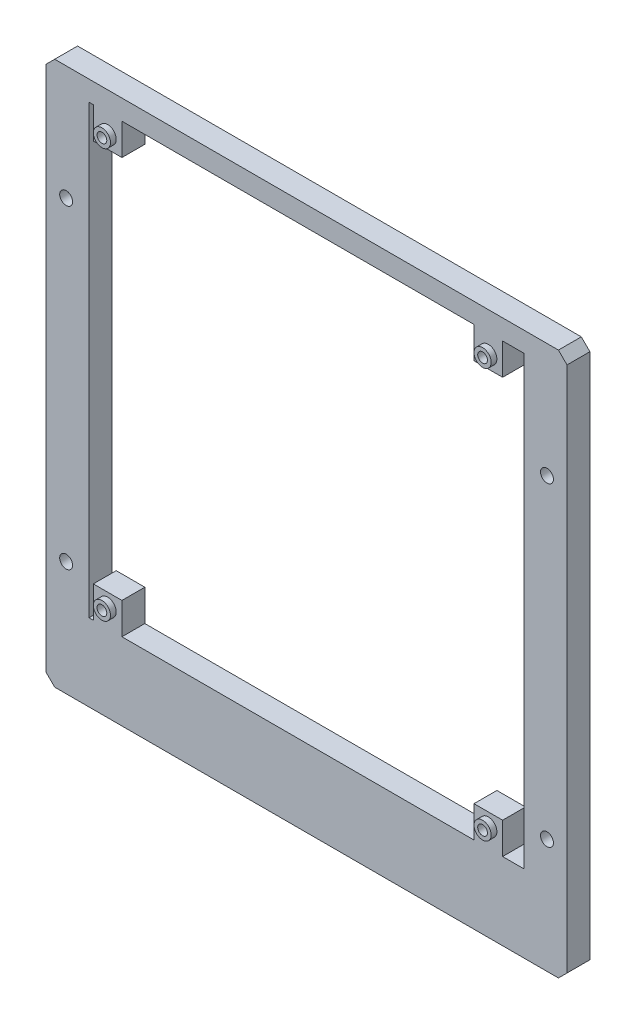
from build123d import *

# Parameters (mm, degrees)
SKETCH_1_R                          = 2.25
SKETCH_1_W                          = 152
SKETCH_1_H                          = 156
COMMON_OPEN_FRAME_M4_HOLES_DEPTH    = 8
SKETCH_2_W                          = 10
SKETCH_2_H                          = 35
SKETCH_2_R                          = 1.7
JOINED_PCB_MOUNT_TAB_1_DEPTH        = 8
SKETCH_3_W                          = 10
SKETCH_3_H                          = 35
SKETCH_3_R                          = 1.7
JOINED_PCB_MOUNT_TAB_2_DEPTH        = 8
SKETCH_4_W                          = 10
SKETCH_4_H                          = 15
SKETCH_4_R                          = 1.7
JOINED_PCB_MOUNT_TAB_3_DEPTH        = 8
SKETCH_5_W                          = 10
SKETCH_5_H                          = 15
SKETCH_5_R                          = 1.7
JOINED_PCB_MOUNT_TAB_4_DEPTH        = 8
FOUR_FRONT_CONTACT_BOSSES_OD6_START = 8
SKETCH_6_R                          = 3
SKETCH_6_R_2                        = 1.7
FOUR_FRONT_CONTACT_BOSSES_OD6_DEPTH = 2


with BuildPart() as part:
    # Sketch 1 → Common_open_frame_M4_holes (new body)
    with BuildSketch(Plane.XY):
        Polygon((-98, -95), (78, -95), (81, -92), (81, 92), (78, 95), (-98, 95), (-101, 92), (-101, -92), align=None)
        with Locations((-94, -55)):
            Circle(SKETCH_1_R, mode=Mode.SUBTRACT)
        with Locations((-94, 55)):
            Circle(SKETCH_1_R, mode=Mode.SUBTRACT)
        with Locations((74, -55)):
            Circle(SKETCH_1_R, mode=Mode.SUBTRACT)
        with Locations((74, 55)):
            Circle(SKETCH_1_R, mode=Mode.SUBTRACT)
        with Locations((-10, 10)):
            Rectangle(SKETCH_1_W, SKETCH_1_H, mode=Mode.SUBTRACT)
    extrude(amount=COMMON_OPEN_FRAME_M4_HOLES_DEPTH)

    # Sketch 2 → Joined_PCB_mount_tab_1 (add)
    with BuildSketch(Plane.XY):
        with Locations((-79.5, -74.5)):
            Rectangle(SKETCH_2_W, SKETCH_2_H)
        with Locations((-79.5, -61.5)):
            Circle(SKETCH_2_R, mode=Mode.SUBTRACT)
    extrude(amount=JOINED_PCB_MOUNT_TAB_1_DEPTH)

    # Sketch 3 → Joined_PCB_mount_tab_2 (add)
    with BuildSketch(Plane.XY):
        with Locations((53.5, -74.5)):
            Rectangle(SKETCH_3_W, SKETCH_3_H)
        with Locations((53.5, -61.5)):
            Circle(SKETCH_3_R, mode=Mode.SUBTRACT)
    extrude(amount=JOINED_PCB_MOUNT_TAB_2_DEPTH)

    # Sketch 4 → Joined_PCB_mount_tab_3 (add)
    with BuildSketch(Plane.XY):
        with Locations((-79.5, 84.5)):
            Rectangle(SKETCH_4_W, SKETCH_4_H)
        with Locations((-79.5, 81.5)):
            Circle(SKETCH_4_R, mode=Mode.SUBTRACT)
    extrude(amount=JOINED_PCB_MOUNT_TAB_3_DEPTH)

    # Sketch 5 → Joined_PCB_mount_tab_4 (add)
    with BuildSketch(Plane.XY):
        with Locations((53.5, 84.5)):
            Rectangle(SKETCH_5_W, SKETCH_5_H)
        with Locations((53.5, 81.5)):
            Circle(SKETCH_5_R, mode=Mode.SUBTRACT)
    extrude(amount=JOINED_PCB_MOUNT_TAB_4_DEPTH)

    # Sketch 6 → Four_front_contact_bosses_OD6 (add)
    # profile 1 of 4: a face of its own
    with BuildSketch(Plane.XY.offset(FOUR_FRONT_CONTACT_BOSSES_OD6_START)):
        with Locations((-79.5, -61.5)):
            Circle(SKETCH_6_R)
        with Locations((-79.5, -61.5)):
            Circle(SKETCH_6_R_2, mode=Mode.SUBTRACT)
    # profile 2 of 4: a face of its own
    with BuildSketch(Plane.XY.offset(FOUR_FRONT_CONTACT_BOSSES_OD6_START)):
        with Locations((53.5, -61.5)):
            Circle(SKETCH_6_R)
        with Locations((53.5, -61.5)):
            Circle(SKETCH_6_R_2, mode=Mode.SUBTRACT)
    # profile 3 of 4: a face of its own
    with BuildSketch(Plane.XY.offset(FOUR_FRONT_CONTACT_BOSSES_OD6_START)):
        with Locations((-79.5, 81.5)):
            Circle(SKETCH_6_R)
        with Locations((-79.5, 81.5)):
            Circle(SKETCH_6_R_2, mode=Mode.SUBTRACT)
    # profile 4 of 4: a face of its own
    with BuildSketch(Plane.XY.offset(FOUR_FRONT_CONTACT_BOSSES_OD6_START)):
        with Locations((53.5, 81.5)):
            Circle(SKETCH_6_R)
        with Locations((53.5, 81.5)):
            Circle(SKETCH_6_R_2, mode=Mode.SUBTRACT)
    extrude(amount=FOUR_FRONT_CONTACT_BOSSES_OD6_DEPTH)


solid = part.part
